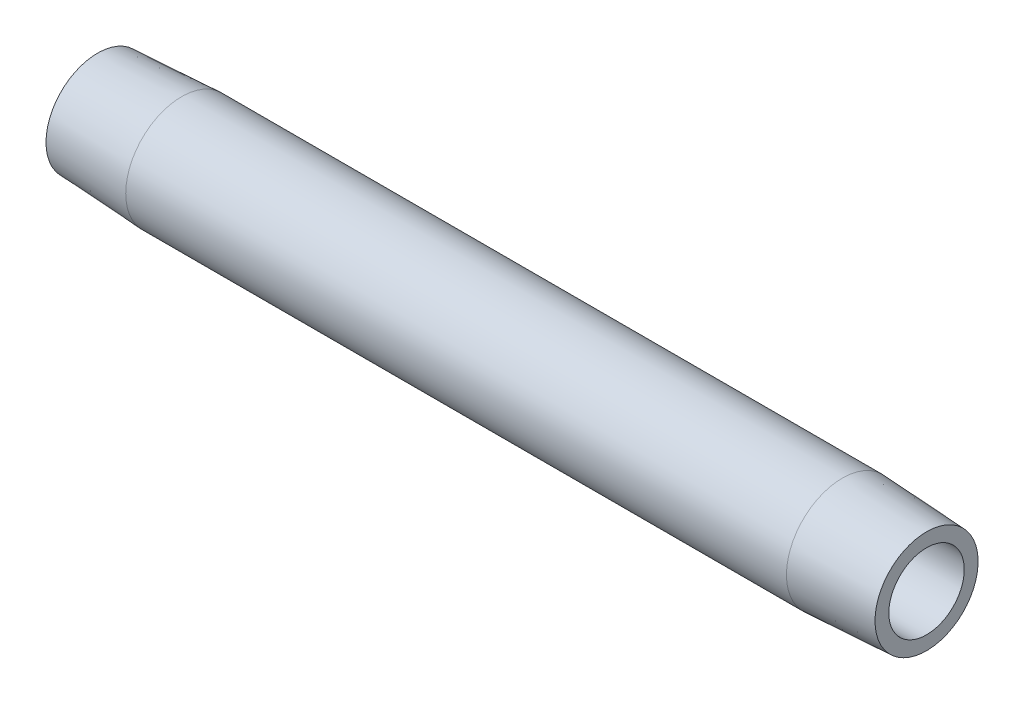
ISO-10303-21;
HEADER;
FILE_DESCRIPTION(('STEP AP214'),'2;1');
FILE_NAME('part.step','',(''),(''),'','','');
FILE_SCHEMA(('AUTOMOTIVE_DESIGN { 1 0 10303 214 1 1 1 1 }'));
ENDSEC;
DATA;
#1=APPLICATION_CONTEXT('core data for automotive mechanical design processes');
#2=APPLICATION_PROTOCOL_DEFINITION('international standard','automotive_design',2000,#1);
#3=PRODUCT_CONTEXT('',#1,'mechanical');
#4=PRODUCT('Part','Part','',(#3));
#5=PRODUCT_RELATED_PRODUCT_CATEGORY('part','',(#4));
#6=PRODUCT_DEFINITION_FORMATION('','',#4);
#7=PRODUCT_DEFINITION_CONTEXT('part definition',#1,'design');
#8=PRODUCT_DEFINITION('design','',#6,#7);
#9=PRODUCT_DEFINITION_SHAPE('','',#8);
#10=(LENGTH_UNIT() NAMED_UNIT(*) SI_UNIT(.MILLI.,.METRE.));
#11=(NAMED_UNIT(*) PLANE_ANGLE_UNIT() SI_UNIT($,.RADIAN.));
#12=(NAMED_UNIT(*) SI_UNIT($,.STERADIAN.) SOLID_ANGLE_UNIT());
#13=UNCERTAINTY_MEASURE_WITH_UNIT(LENGTH_MEASURE(1.E-05),#10,'distance_accuracy_value','');
#14=(GEOMETRIC_REPRESENTATION_CONTEXT(3) GLOBAL_UNCERTAINTY_ASSIGNED_CONTEXT((#13)) GLOBAL_UNIT_ASSIGNED_CONTEXT((#10,
#11,#12)) REPRESENTATION_CONTEXT('',''));
#15=CARTESIAN_POINT('',(0.,0.,0.));
#16=DIRECTION('',(0.,0.,1.));
#17=DIRECTION('',(1.,0.,0.));
#18=AXIS2_PLACEMENT_3D('',#15,#16,#17);
#19=CARTESIAN_POINT('',(101.6,0.,-4.62277681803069));
#20=DIRECTION('',(-1.,0.,0.));
#21=DIRECTION('',(0.,0.,1.));
#22=AXIS2_PLACEMENT_3D('',#19,#20,#21);
#23=PLANE('',#22);
#24=CARTESIAN_POINT('',(101.6,0.,0.));
#25=DIRECTION('',(-1.,0.,0.));
#26=DIRECTION('',(0.,0.,1.));
#27=AXIS2_PLACEMENT_3D('',#24,#25,#26);
#28=CIRCLE('',#27,6.31752683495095);
#29=CARTESIAN_POINT('',(101.6,0.,6.31752683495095));
#30=VERTEX_POINT('',#29);
#31=EDGE_CURVE('E10',#30,#30,#28,.T.);
#32=ORIENTED_EDGE('',*,*,#31,.F.);
#33=EDGE_LOOP('',(#32));
#34=FACE_BOUND('',#33,.T.);
#35=CARTESIAN_POINT('',(101.6,0.,0.));
#36=DIRECTION('',(-1.,0.,0.));
#37=DIRECTION('',(0.,0.,1.));
#38=AXIS2_PLACEMENT_3D('',#35,#36,#37);
#39=CIRCLE('',#38,4.62277681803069);
#40=CARTESIAN_POINT('',(101.6,0.,4.62277681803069));
#41=VERTEX_POINT('',#40);
#42=EDGE_CURVE('E52',#41,#41,#39,.T.);
#43=ORIENTED_EDGE('',*,*,#42,.T.);
#44=EDGE_LOOP('',(#43));
#45=FACE_BOUND('',#44,.T.);
#46=ADVANCED_FACE('F30',(#34,#45),#23,.F.);
#47=CARTESIAN_POINT('',(101.6,0.,0.));
#48=DIRECTION('',(-1.,0.,0.));
#49=DIRECTION('',(0.,0.,1.));
#50=AXIS2_PLACEMENT_3D('',#47,#48,#49);
#51=CONICAL_SURFACE('',#50,6.31752683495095,0.052359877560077);
#52=CARTESIAN_POINT('',(91.2876000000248,0.,0.));
#53=DIRECTION('',(-1.,0.,0.));
#54=DIRECTION('',(0.,0.,1.));
#55=AXIS2_PLACEMENT_3D('',#52,#53,#54);
#56=CIRCLE('',#55,6.85797681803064);
#57=CARTESIAN_POINT('',(91.2876000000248,0.,6.85797681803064));
#58=VERTEX_POINT('',#57);
#59=EDGE_CURVE('E36',#58,#58,#56,.T.);
#60=ORIENTED_EDGE('',*,*,#59,.F.);
#61=EDGE_LOOP('',(#60));
#62=FACE_BOUND('',#61,.T.);
#63=ORIENTED_EDGE('',*,*,#31,.T.);
#64=EDGE_LOOP('',(#63));
#65=FACE_BOUND('',#64,.T.);
#66=ADVANCED_FACE('F77',(#62,#65),#51,.T.);
#67=CARTESIAN_POINT('',(-6.37599469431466,0.,0.));
#68=DIRECTION('',(-1.,0.,0.));
#69=DIRECTION('',(0.,0.,1.));
#70=AXIS2_PLACEMENT_3D('',#67,#68,#69);
#71=CYLINDRICAL_SURFACE('',#70,6.85797681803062);
#72=CARTESIAN_POINT('',(10.3123999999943,0.,0.));
#73=DIRECTION('',(-1.,0.,0.));
#74=DIRECTION('',(0.,0.,1.));
#75=AXIS2_PLACEMENT_3D('',#72,#73,#74);
#76=CIRCLE('',#75,6.8579768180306);
#77=CARTESIAN_POINT('',(10.3123999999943,0.,6.8579768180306));
#78=VERTEX_POINT('',#77);
#79=EDGE_CURVE('E40',#78,#78,#76,.T.);
#80=ORIENTED_EDGE('',*,*,#79,.F.);
#81=EDGE_LOOP('',(#80));
#82=FACE_BOUND('',#81,.T.);
#83=ORIENTED_EDGE('',*,*,#59,.T.);
#84=EDGE_LOOP('',(#83));
#85=FACE_BOUND('',#84,.T.);
#86=ADVANCED_FACE('F72',(#82,#85),#71,.T.);
#87=CARTESIAN_POINT('',(10.3123999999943,0.,0.));
#88=DIRECTION('',(1.,0.,0.));
#89=DIRECTION('',(0.,0.,-1.));
#90=AXIS2_PLACEMENT_3D('',#87,#88,#89);
#91=CONICAL_SURFACE('',#90,6.8579768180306,0.0523598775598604);
#92=CARTESIAN_POINT('',(1.90819582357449E-11,0.,0.));
#93=DIRECTION('',(-1.,0.,0.));
#94=DIRECTION('',(0.,0.,1.));
#95=AXIS2_PLACEMENT_3D('',#92,#93,#94);
#96=CIRCLE('',#95,6.31752683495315);
#97=CARTESIAN_POINT('',(1.90819582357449E-11,0.,6.31752683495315));
#98=VERTEX_POINT('',#97);
#99=EDGE_CURVE('E44',#98,#98,#96,.T.);
#100=ORIENTED_EDGE('',*,*,#99,.F.);
#101=EDGE_LOOP('',(#100));
#102=FACE_BOUND('',#101,.T.);
#103=ORIENTED_EDGE('',*,*,#79,.T.);
#104=EDGE_LOOP('',(#103));
#105=FACE_BOUND('',#104,.T.);
#106=ADVANCED_FACE('F66',(#102,#105),#91,.T.);
#107=CARTESIAN_POINT('',(1.90819582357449E-11,0.,-6.31752683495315));
#108=DIRECTION('',(1.,0.,0.));
#109=DIRECTION('',(0.,0.,-1.));
#110=AXIS2_PLACEMENT_3D('',#107,#108,#109);
#111=PLANE('',#110);
#112=CARTESIAN_POINT('',(1.90819582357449E-11,0.,0.));
#113=DIRECTION('',(-1.,0.,0.));
#114=DIRECTION('',(0.,0.,1.));
#115=AXIS2_PLACEMENT_3D('',#112,#113,#114);
#116=CIRCLE('',#115,4.62277681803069);
#117=CARTESIAN_POINT('',(1.90819582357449E-11,0.,4.62277681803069));
#118=VERTEX_POINT('',#117);
#119=EDGE_CURVE('E49',#118,#118,#116,.T.);
#120=ORIENTED_EDGE('',*,*,#119,.F.);
#121=EDGE_LOOP('',(#120));
#122=FACE_BOUND('',#121,.T.);
#123=ORIENTED_EDGE('',*,*,#99,.T.);
#124=EDGE_LOOP('',(#123));
#125=FACE_BOUND('',#124,.T.);
#126=ADVANCED_FACE('F60',(#122,#125),#111,.F.);
#127=CARTESIAN_POINT('',(-6.37599469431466,0.,0.));
#128=DIRECTION('',(-1.,0.,0.));
#129=DIRECTION('',(0.,0.,1.));
#130=AXIS2_PLACEMENT_3D('',#127,#128,#129);
#131=CYLINDRICAL_SURFACE('',#130,4.62277681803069);
#132=ORIENTED_EDGE('',*,*,#42,.F.);
#133=EDGE_LOOP('',(#132));
#134=FACE_BOUND('',#133,.T.);
#135=ORIENTED_EDGE('',*,*,#119,.T.);
#136=EDGE_LOOP('',(#135));
#137=FACE_BOUND('',#136,.T.);
#138=ADVANCED_FACE('F57',(#134,#137),#131,.F.);
#139=CLOSED_SHELL('',(#46,#66,#86,#106,#126,#138));
#140=MANIFOLD_SOLID_BREP('B2',#139);
#141=ADVANCED_BREP_SHAPE_REPRESENTATION('',(#18,#140),#14);
#142=SHAPE_DEFINITION_REPRESENTATION(#9,#141);
ENDSEC;
END-ISO-10303-21;
